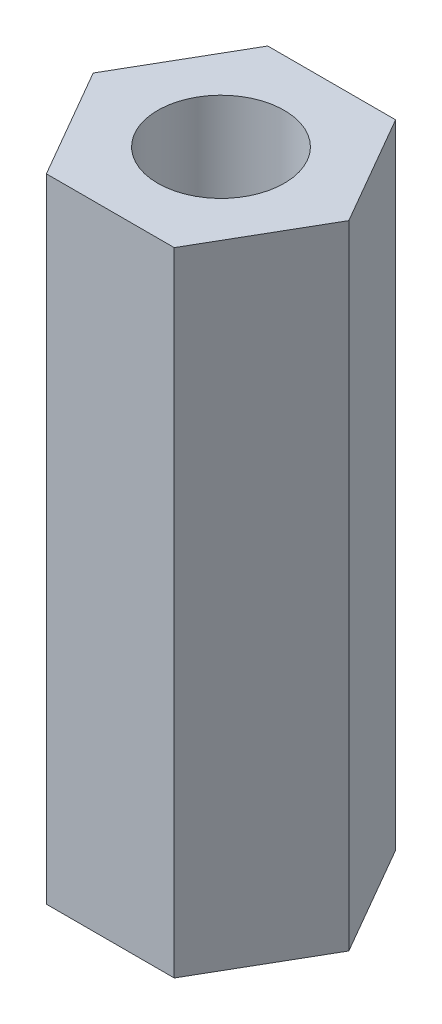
from build123d import *

# Parameters (mm, degrees)
SKETCH1_R           = 2
BOSS_EXTRUDE1_DEPTH = 20


with BuildPart() as part:
    # Sketch1 → Boss-Extrude1 (new body)
    with BuildSketch(Plane(origin=(0, 0, 0), x_dir=(1, 0, 0), z_dir=(0, 1, 0))):
        Polygon((2.020725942, 3.5), (-2.020725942, 3.5), (-4.041451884, 0), (-2.020725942, -3.5), (2.020725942, -3.5), (4.041451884, 0), align=None)
        with Locations(Location((0, 0, 0), (0, 0, 270))):
            Circle(SKETCH1_R, mode=Mode.SUBTRACT)
    extrude(amount=BOSS_EXTRUDE1_DEPTH)


solid = part.part
